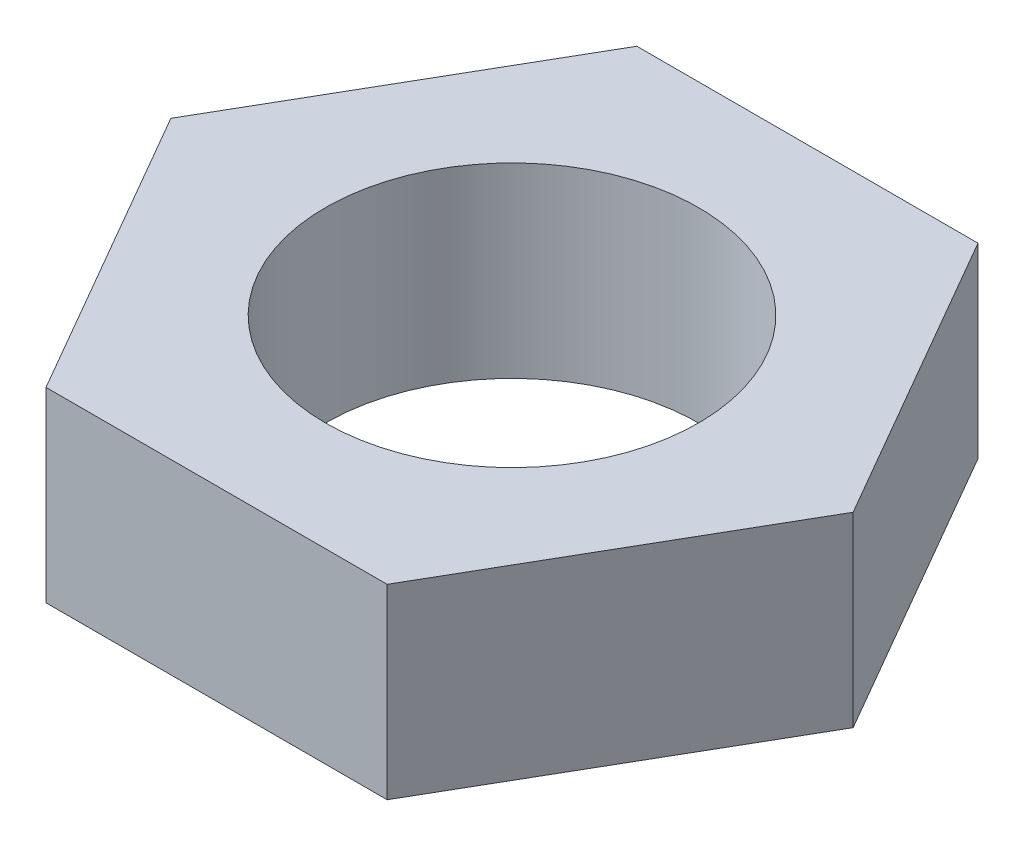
ISO-10303-21;
HEADER;
FILE_DESCRIPTION(('STEP AP214'),'2;1');
FILE_NAME('part.step','',(''),(''),'','','');
FILE_SCHEMA(('AUTOMOTIVE_DESIGN { 1 0 10303 214 1 1 1 1 }'));
ENDSEC;
DATA;
#1=APPLICATION_CONTEXT('core data for automotive mechanical design processes');
#2=APPLICATION_PROTOCOL_DEFINITION('international standard','automotive_design',2000,#1);
#3=PRODUCT_CONTEXT('',#1,'mechanical');
#4=PRODUCT('Part','Part','',(#3));
#5=PRODUCT_RELATED_PRODUCT_CATEGORY('part','',(#4));
#6=PRODUCT_DEFINITION_FORMATION('','',#4);
#7=PRODUCT_DEFINITION_CONTEXT('part definition',#1,'design');
#8=PRODUCT_DEFINITION('design','',#6,#7);
#9=PRODUCT_DEFINITION_SHAPE('','',#8);
#10=(LENGTH_UNIT() NAMED_UNIT(*) SI_UNIT(.MILLI.,.METRE.));
#11=(NAMED_UNIT(*) PLANE_ANGLE_UNIT() SI_UNIT($,.RADIAN.));
#12=(NAMED_UNIT(*) SI_UNIT($,.STERADIAN.) SOLID_ANGLE_UNIT());
#13=UNCERTAINTY_MEASURE_WITH_UNIT(LENGTH_MEASURE(1.E-05),#10,'distance_accuracy_value','');
#14=(GEOMETRIC_REPRESENTATION_CONTEXT(3) GLOBAL_UNCERTAINTY_ASSIGNED_CONTEXT((#13)) GLOBAL_UNIT_ASSIGNED_CONTEXT((#10,
#11,#12)) REPRESENTATION_CONTEXT('',''));
#15=CARTESIAN_POINT('',(0.,0.,0.));
#16=DIRECTION('',(0.,0.,1.));
#17=DIRECTION('',(1.,0.,0.));
#18=AXIS2_PLACEMENT_3D('',#15,#16,#17);
#19=CARTESIAN_POINT('',(-17.4143274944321,19.05,30.1625));
#20=DIRECTION('',(0.,0.,-1.));
#21=DIRECTION('',(-1.,0.,0.));
#22=AXIS2_PLACEMENT_3D('',#19,#20,#21);
#23=PLANE('',#22);
#24=DIRECTION('',(1.,0.,0.));
#25=VECTOR('',#24,1.);
#26=CARTESIAN_POINT('',(-17.4143274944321,0.,30.1625));
#27=LINE('',#26,#25);
#28=CARTESIAN_POINT('',(-17.4143274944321,0.,30.1625));
#29=VERTEX_POINT('',#28);
#30=CARTESIAN_POINT('',(17.4143274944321,0.,30.1625));
#31=VERTEX_POINT('',#30);
#32=EDGE_CURVE('E119',#29,#31,#27,.T.);
#33=ORIENTED_EDGE('',*,*,#32,.T.);
#34=DIRECTION('',(0.,-1.,0.));
#35=VECTOR('',#34,1.);
#36=CARTESIAN_POINT('',(17.4143274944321,19.05,30.1625));
#37=LINE('',#36,#35);
#38=CARTESIAN_POINT('',(17.4143274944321,19.05,30.1625));
#39=VERTEX_POINT('',#38);
#40=EDGE_CURVE('E11',#39,#31,#37,.T.);
#41=ORIENTED_EDGE('',*,*,#40,.F.);
#42=DIRECTION('',(1.,0.,0.));
#43=VECTOR('',#42,1.);
#44=CARTESIAN_POINT('',(-17.4143274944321,19.05,30.1625));
#45=LINE('',#44,#43);
#46=CARTESIAN_POINT('',(-17.4143274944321,19.05,30.1625));
#47=VERTEX_POINT('',#46);
#48=EDGE_CURVE('E130',#47,#39,#45,.T.);
#49=ORIENTED_EDGE('',*,*,#48,.F.);
#50=DIRECTION('',(0.,-1.,0.));
#51=VECTOR('',#50,1.);
#52=CARTESIAN_POINT('',(-17.4143274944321,19.05,30.1625));
#53=LINE('',#52,#51);
#54=EDGE_CURVE('E115',#47,#29,#53,.T.);
#55=ORIENTED_EDGE('',*,*,#54,.T.);
#56=EDGE_LOOP('',(#33,#41,#49,#55));
#57=FACE_BOUND('',#56,.T.);
#58=ADVANCED_FACE('F35',(#57),#23,.F.);
#59=CARTESIAN_POINT('',(17.4143274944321,19.05,30.1625));
#60=DIRECTION('',(-0.866025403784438,0.,-0.5));
#61=DIRECTION('',(-0.5,0.,0.866025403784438));
#62=AXIS2_PLACEMENT_3D('',#59,#60,#61);
#63=PLANE('',#62);
#64=DIRECTION('',(0.5,0.,-0.866025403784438));
#65=VECTOR('',#64,1.);
#66=CARTESIAN_POINT('',(17.4143274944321,0.,30.1625));
#67=LINE('',#66,#65);
#68=CARTESIAN_POINT('',(34.8286549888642,0.,0.));
#69=VERTEX_POINT('',#68);
#70=EDGE_CURVE('E122',#31,#69,#67,.T.);
#71=ORIENTED_EDGE('',*,*,#70,.T.);
#72=DIRECTION('',(0.,-1.,0.));
#73=VECTOR('',#72,1.);
#74=CARTESIAN_POINT('',(34.8286549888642,19.05,0.));
#75=LINE('',#74,#73);
#76=CARTESIAN_POINT('',(34.8286549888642,19.05,0.));
#77=VERTEX_POINT('',#76);
#78=EDGE_CURVE('E43',#77,#69,#75,.T.);
#79=ORIENTED_EDGE('',*,*,#78,.F.);
#80=DIRECTION('',(0.5,0.,-0.866025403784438));
#81=VECTOR('',#80,1.);
#82=CARTESIAN_POINT('',(17.4143274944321,19.05,30.1625));
#83=LINE('',#82,#81);
#84=EDGE_CURVE('E88',#39,#77,#83,.T.);
#85=ORIENTED_EDGE('',*,*,#84,.F.);
#86=ORIENTED_EDGE('',*,*,#40,.T.);
#87=EDGE_LOOP('',(#71,#79,#85,#86));
#88=FACE_BOUND('',#87,.T.);
#89=ADVANCED_FACE('F155',(#88),#63,.F.);
#90=CARTESIAN_POINT('',(34.8286549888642,19.05,0.));
#91=DIRECTION('',(-0.866025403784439,0.,0.5));
#92=DIRECTION('',(0.5,0.,0.866025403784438));
#93=AXIS2_PLACEMENT_3D('',#90,#91,#92);
#94=PLANE('',#93);
#95=DIRECTION('',(-0.5,0.,-0.866025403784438));
#96=VECTOR('',#95,1.);
#97=CARTESIAN_POINT('',(34.8286549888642,0.,0.));
#98=LINE('',#97,#96);
#99=CARTESIAN_POINT('',(17.4143274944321,0.,-30.1625));
#100=VERTEX_POINT('',#99);
#101=EDGE_CURVE('E125',#69,#100,#98,.T.);
#102=ORIENTED_EDGE('',*,*,#101,.T.);
#103=DIRECTION('',(0.,-1.,0.));
#104=VECTOR('',#103,1.);
#105=CARTESIAN_POINT('',(17.4143274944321,19.05,-30.1625));
#106=LINE('',#105,#104);
#107=CARTESIAN_POINT('',(17.4143274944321,19.05,-30.1625));
#108=VERTEX_POINT('',#107);
#109=EDGE_CURVE('E110',#108,#100,#106,.T.);
#110=ORIENTED_EDGE('',*,*,#109,.F.);
#111=DIRECTION('',(-0.5,0.,-0.866025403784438));
#112=VECTOR('',#111,1.);
#113=CARTESIAN_POINT('',(34.8286549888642,19.05,0.));
#114=LINE('',#113,#112);
#115=EDGE_CURVE('E101',#77,#108,#114,.T.);
#116=ORIENTED_EDGE('',*,*,#115,.F.);
#117=ORIENTED_EDGE('',*,*,#78,.T.);
#118=EDGE_LOOP('',(#102,#110,#116,#117));
#119=FACE_BOUND('',#118,.T.);
#120=ADVANCED_FACE('F136',(#119),#94,.F.);
#121=CARTESIAN_POINT('',(17.4143274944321,19.05,-30.1625));
#122=DIRECTION('',(0.,0.,1.));
#123=DIRECTION('',(1.,0.,0.));
#124=AXIS2_PLACEMENT_3D('',#121,#122,#123);
#125=PLANE('',#124);
#126=DIRECTION('',(-1.,0.,0.));
#127=VECTOR('',#126,1.);
#128=CARTESIAN_POINT('',(17.4143274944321,0.,-30.1625));
#129=LINE('',#128,#127);
#130=CARTESIAN_POINT('',(-17.4143274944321,0.,-30.1625));
#131=VERTEX_POINT('',#130);
#132=EDGE_CURVE('E109',#100,#131,#129,.T.);
#133=ORIENTED_EDGE('',*,*,#132,.T.);
#134=DIRECTION('',(0.,-1.,0.));
#135=VECTOR('',#134,1.);
#136=CARTESIAN_POINT('',(-17.4143274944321,19.05,-30.1625));
#137=LINE('',#136,#135);
#138=CARTESIAN_POINT('',(-17.4143274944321,19.05,-30.1625));
#139=VERTEX_POINT('',#138);
#140=EDGE_CURVE('E106',#139,#131,#137,.T.);
#141=ORIENTED_EDGE('',*,*,#140,.F.);
#142=DIRECTION('',(-1.,0.,0.));
#143=VECTOR('',#142,1.);
#144=CARTESIAN_POINT('',(17.4143274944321,19.05,-30.1625));
#145=LINE('',#144,#143);
#146=EDGE_CURVE('E95',#108,#139,#145,.T.);
#147=ORIENTED_EDGE('',*,*,#146,.F.);
#148=ORIENTED_EDGE('',*,*,#109,.T.);
#149=EDGE_LOOP('',(#133,#141,#147,#148));
#150=FACE_BOUND('',#149,.T.);
#151=ADVANCED_FACE('F107',(#150),#125,.F.);
#152=CARTESIAN_POINT('',(-17.4143274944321,19.05,-30.1625));
#153=DIRECTION('',(0.866025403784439,0.,0.5));
#154=DIRECTION('',(0.5,0.,-0.866025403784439));
#155=AXIS2_PLACEMENT_3D('',#152,#153,#154);
#156=PLANE('',#155);
#157=DIRECTION('',(-0.5,0.,0.866025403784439));
#158=VECTOR('',#157,1.);
#159=CARTESIAN_POINT('',(-17.4143274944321,0.,-30.1625));
#160=LINE('',#159,#158);
#161=CARTESIAN_POINT('',(-34.8286549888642,0.,0.));
#162=VERTEX_POINT('',#161);
#163=EDGE_CURVE('E74',#131,#162,#160,.T.);
#164=ORIENTED_EDGE('',*,*,#163,.T.);
#165=DIRECTION('',(0.,-1.,0.));
#166=VECTOR('',#165,1.);
#167=CARTESIAN_POINT('',(-34.8286549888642,19.05,0.));
#168=LINE('',#167,#166);
#169=CARTESIAN_POINT('',(-34.8286549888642,19.05,0.));
#170=VERTEX_POINT('',#169);
#171=EDGE_CURVE('E111',#170,#162,#168,.T.);
#172=ORIENTED_EDGE('',*,*,#171,.F.);
#173=DIRECTION('',(-0.5,0.,0.866025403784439));
#174=VECTOR('',#173,1.);
#175=CARTESIAN_POINT('',(-17.4143274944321,19.05,-30.1625));
#176=LINE('',#175,#174);
#177=EDGE_CURVE('E99',#139,#170,#176,.T.);
#178=ORIENTED_EDGE('',*,*,#177,.F.);
#179=ORIENTED_EDGE('',*,*,#140,.T.);
#180=EDGE_LOOP('',(#164,#172,#178,#179));
#181=FACE_BOUND('',#180,.T.);
#182=ADVANCED_FACE('F113',(#181),#156,.F.);
#183=CARTESIAN_POINT('',(-34.8286549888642,19.05,0.));
#184=DIRECTION('',(0.866025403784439,0.,-0.5));
#185=DIRECTION('',(-0.5,0.,-0.866025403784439));
#186=AXIS2_PLACEMENT_3D('',#183,#184,#185);
#187=PLANE('',#186);
#188=DIRECTION('',(0.5,0.,0.866025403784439));
#189=VECTOR('',#188,1.);
#190=CARTESIAN_POINT('',(-34.8286549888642,0.,0.));
#191=LINE('',#190,#189);
#192=EDGE_CURVE('E80',#162,#29,#191,.T.);
#193=ORIENTED_EDGE('',*,*,#192,.T.);
#194=ORIENTED_EDGE('',*,*,#54,.F.);
#195=DIRECTION('',(0.5,0.,0.866025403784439));
#196=VECTOR('',#195,1.);
#197=CARTESIAN_POINT('',(-34.8286549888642,19.05,0.));
#198=LINE('',#197,#196);
#199=EDGE_CURVE('E51',#170,#47,#198,.T.);
#200=ORIENTED_EDGE('',*,*,#199,.F.);
#201=ORIENTED_EDGE('',*,*,#171,.T.);
#202=EDGE_LOOP('',(#193,#194,#200,#201));
#203=FACE_BOUND('',#202,.T.);
#204=ADVANCED_FACE('F143',(#203),#187,.F.);
#205=CARTESIAN_POINT('',(0.,19.05,0.));
#206=DIRECTION('',(0.,1.,0.));
#207=DIRECTION('',(0.,0.,1.));
#208=AXIS2_PLACEMENT_3D('',#205,#206,#207);
#209=PLANE('',#208);
#210=CARTESIAN_POINT('',(0.,19.05,0.));
#211=DIRECTION('',(0.,1.,0.));
#212=DIRECTION('',(0.,0.,1.));
#213=AXIS2_PLACEMENT_3D('',#210,#211,#212);
#214=CIRCLE('',#213,19.05);
#215=CARTESIAN_POINT('',(0.,19.05,19.05));
#216=VERTEX_POINT('',#215);
#217=EDGE_CURVE('E123',#216,#216,#214,.F.);
#218=ORIENTED_EDGE('',*,*,#217,.T.);
#219=EDGE_LOOP('',(#218));
#220=FACE_BOUND('',#219,.T.);
#221=ORIENTED_EDGE('',*,*,#48,.T.);
#222=ORIENTED_EDGE('',*,*,#84,.T.);
#223=ORIENTED_EDGE('',*,*,#115,.T.);
#224=ORIENTED_EDGE('',*,*,#146,.T.);
#225=ORIENTED_EDGE('',*,*,#177,.T.);
#226=ORIENTED_EDGE('',*,*,#199,.T.);
#227=EDGE_LOOP('',(#221,#222,#223,#224,#225,#226));
#228=FACE_BOUND('',#227,.T.);
#229=ADVANCED_FACE('F97',(#220,#228),#209,.T.);
#230=CARTESIAN_POINT('',(0.,0.,0.));
#231=DIRECTION('',(0.,1.,0.));
#232=DIRECTION('',(0.,0.,1.));
#233=AXIS2_PLACEMENT_3D('',#230,#231,#232);
#234=PLANE('',#233);
#235=CARTESIAN_POINT('',(0.,0.,0.));
#236=DIRECTION('',(0.,1.,0.));
#237=DIRECTION('',(0.,0.,1.));
#238=AXIS2_PLACEMENT_3D('',#235,#236,#237);
#239=CIRCLE('',#238,19.05);
#240=CARTESIAN_POINT('',(0.,0.,19.05));
#241=VERTEX_POINT('',#240);
#242=EDGE_CURVE('E210',#241,#241,#239,.T.);
#243=ORIENTED_EDGE('',*,*,#242,.T.);
#244=EDGE_LOOP('',(#243));
#245=FACE_BOUND('',#244,.T.);
#246=ORIENTED_EDGE('',*,*,#32,.F.);
#247=ORIENTED_EDGE('',*,*,#192,.F.);
#248=ORIENTED_EDGE('',*,*,#163,.F.);
#249=ORIENTED_EDGE('',*,*,#132,.F.);
#250=ORIENTED_EDGE('',*,*,#101,.F.);
#251=ORIENTED_EDGE('',*,*,#70,.F.);
#252=EDGE_LOOP('',(#246,#247,#248,#249,#250,#251));
#253=FACE_BOUND('',#252,.T.);
#254=ADVANCED_FACE('F139',(#245,#253),#234,.F.);
#255=CARTESIAN_POINT('',(0.,101.6,0.));
#256=DIRECTION('',(0.,-1.,0.));
#257=DIRECTION('',(0.,0.,-1.));
#258=AXIS2_PLACEMENT_3D('',#255,#256,#257);
#259=CYLINDRICAL_SURFACE('',#258,19.05);
#260=ORIENTED_EDGE('',*,*,#217,.F.);
#261=EDGE_LOOP('',(#260));
#262=FACE_BOUND('',#261,.T.);
#263=ORIENTED_EDGE('',*,*,#242,.F.);
#264=EDGE_LOOP('',(#263));
#265=FACE_BOUND('',#264,.T.);
#266=ADVANCED_FACE('F192',(#262,#265),#259,.F.);
#267=CLOSED_SHELL('',(#58,#89,#120,#151,#182,#204,#229,#254,#266));
#268=MANIFOLD_SOLID_BREP('B2',#267);
#269=ADVANCED_BREP_SHAPE_REPRESENTATION('',(#18,#268),#14);
#270=SHAPE_DEFINITION_REPRESENTATION(#9,#269);
ENDSEC;
END-ISO-10303-21;
